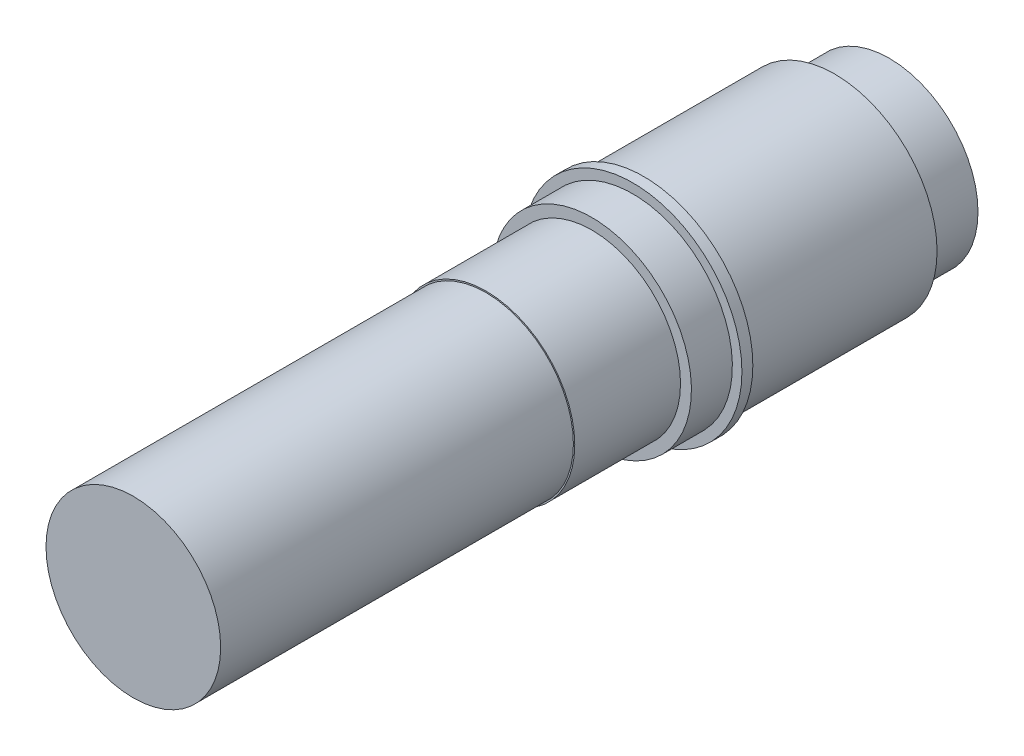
ISO-10303-21;
HEADER;
FILE_DESCRIPTION(('STEP AP214'),'2;1');
FILE_NAME('part.step','',(''),(''),'','','');
FILE_SCHEMA(('AUTOMOTIVE_DESIGN { 1 0 10303 214 1 1 1 1 }'));
ENDSEC;
DATA;
#1=APPLICATION_CONTEXT('core data for automotive mechanical design processes');
#2=APPLICATION_PROTOCOL_DEFINITION('international standard','automotive_design',2000,#1);
#3=PRODUCT_CONTEXT('',#1,'mechanical');
#4=PRODUCT('Part','Part','',(#3));
#5=PRODUCT_RELATED_PRODUCT_CATEGORY('part','',(#4));
#6=PRODUCT_DEFINITION_FORMATION('','',#4);
#7=PRODUCT_DEFINITION_CONTEXT('part definition',#1,'design');
#8=PRODUCT_DEFINITION('design','',#6,#7);
#9=PRODUCT_DEFINITION_SHAPE('','',#8);
#10=(LENGTH_UNIT() NAMED_UNIT(*) SI_UNIT(.MILLI.,.METRE.));
#11=(NAMED_UNIT(*) PLANE_ANGLE_UNIT() SI_UNIT($,.RADIAN.));
#12=(NAMED_UNIT(*) SI_UNIT($,.STERADIAN.) SOLID_ANGLE_UNIT());
#13=UNCERTAINTY_MEASURE_WITH_UNIT(LENGTH_MEASURE(1.E-05),#10,'distance_accuracy_value','');
#14=(GEOMETRIC_REPRESENTATION_CONTEXT(3) GLOBAL_UNCERTAINTY_ASSIGNED_CONTEXT((#13)) GLOBAL_UNIT_ASSIGNED_CONTEXT((#10,
#11,#12)) REPRESENTATION_CONTEXT('',''));
#15=CARTESIAN_POINT('',(0.,0.,0.));
#16=DIRECTION('',(0.,0.,1.));
#17=DIRECTION('',(1.,0.,0.));
#18=AXIS2_PLACEMENT_3D('',#15,#16,#17);
#19=CARTESIAN_POINT('',(139.279894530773,-241.483084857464,-317.356667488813));
#20=DIRECTION('',(0.,0.,1.));
#21=DIRECTION('',(0.,1.,0.));
#22=AXIS2_PLACEMENT_3D('',#19,#20,#21);
#23=PLANE('',#22);
#24=CARTESIAN_POINT('',(71.0299015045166,-173.233091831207,-317.356667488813));
#25=DIRECTION('',(0.,0.,-1.));
#26=DIRECTION('',(-1.,0.,0.));
#27=AXIS2_PLACEMENT_3D('',#24,#25,#26);
#28=CIRCLE('',#27,64.);
#29=CARTESIAN_POINT('',(71.0299015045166,-109.233091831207,-317.356667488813));
#30=VERTEX_POINT('',#29);
#31=EDGE_CURVE('E10',#30,#30,#28,.T.);
#32=ORIENTED_EDGE('',*,*,#31,.T.);
#33=EDGE_LOOP('',(#32));
#34=FACE_BOUND('',#33,.T.);
#35=CARTESIAN_POINT('',(71.0299015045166,-173.233091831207,-317.356667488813));
#36=DIRECTION('',(0.,0.,-1.));
#37=DIRECTION('',(0.,1.,0.));
#38=AXIS2_PLACEMENT_3D('',#35,#36,#37);
#39=CIRCLE('',#38,65.);
#40=CARTESIAN_POINT('',(136.029901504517,-173.233091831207,-317.356667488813));
#41=VERTEX_POINT('',#40);
#42=EDGE_CURVE('E25',#41,#41,#39,.T.);
#43=ORIENTED_EDGE('',*,*,#42,.F.);
#44=EDGE_LOOP('',(#43));
#45=FACE_BOUND('',#44,.T.);
#46=ADVANCED_FACE('F15',(#34,#45),#23,.T.);
#47=CARTESIAN_POINT('',(71.0299015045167,-173.233091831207,-394.856667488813));
#48=DIRECTION('',(0.,0.,1.));
#49=DIRECTION('',(0.,-1.,0.));
#50=AXIS2_PLACEMENT_3D('',#47,#48,#49);
#51=CYLINDRICAL_SURFACE('',#50,65.);
#52=CARTESIAN_POINT('',(71.0299015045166,-173.233091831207,-394.856667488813));
#53=DIRECTION('',(0.,0.,-1.));
#54=DIRECTION('',(0.,1.,0.));
#55=AXIS2_PLACEMENT_3D('',#52,#53,#54);
#56=CIRCLE('',#55,65.);
#57=CARTESIAN_POINT('',(136.029901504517,-173.233091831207,-394.856667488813));
#58=VERTEX_POINT('',#57);
#59=EDGE_CURVE('E80',#58,#58,#56,.T.);
#60=ORIENTED_EDGE('',*,*,#59,.F.);
#61=DIRECTION('',(0.,0.,-1.));
#62=VECTOR('',#61,1.);
#63=CARTESIAN_POINT('',(136.029901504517,-173.233091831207,-356.106667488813));
#64=LINE('',#63,#62);
#65=EDGE_CURVE('E83',#41,#58,#64,.T.);
#66=ORIENTED_EDGE('',*,*,#65,.F.);
#67=ORIENTED_EDGE('',*,*,#42,.T.);
#68=ORIENTED_EDGE('',*,*,#65,.T.);
#69=EDGE_LOOP('',(#60,#66,#67,#68));
#70=FACE_BOUND('',#69,.T.);
#71=ADVANCED_FACE('F120',(#70),#51,.T.);
#72=CARTESIAN_POINT('',(-5.62009215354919,-249.883085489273,-394.856667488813));
#73=DIRECTION('',(0.,0.,1.));
#74=DIRECTION('',(1.,0.,0.));
#75=AXIS2_PLACEMENT_3D('',#72,#73,#74);
#76=PLANE('',#75);
#77=ORIENTED_EDGE('',*,*,#59,.T.);
#78=EDGE_LOOP('',(#77));
#79=FACE_BOUND('',#78,.T.);
#80=CARTESIAN_POINT('',(71.0299015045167,-173.233091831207,-394.856667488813));
#81=DIRECTION('',(0.,0.,-1.));
#82=DIRECTION('',(-1.,0.,0.));
#83=AXIS2_PLACEMENT_3D('',#80,#81,#82);
#84=CIRCLE('',#83,73.);
#85=CARTESIAN_POINT('',(71.0299015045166,-246.233091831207,-394.856667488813));
#86=VERTEX_POINT('',#85);
#87=EDGE_CURVE('E74',#86,#86,#84,.T.);
#88=ORIENTED_EDGE('',*,*,#87,.F.);
#89=EDGE_LOOP('',(#88));
#90=FACE_BOUND('',#89,.T.);
#91=ADVANCED_FACE('F79',(#79,#90),#76,.T.);
#92=CARTESIAN_POINT('',(71.0299015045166,-173.233091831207,-424.856667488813));
#93=DIRECTION('',(0.,0.,1.));
#94=DIRECTION('',(1.,0.,0.));
#95=AXIS2_PLACEMENT_3D('',#92,#93,#94);
#96=CYLINDRICAL_SURFACE('',#95,73.);
#97=CARTESIAN_POINT('',(71.0299015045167,-173.233091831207,-424.856667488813));
#98=DIRECTION('',(0.,0.,-1.));
#99=DIRECTION('',(-1.,0.,0.));
#100=AXIS2_PLACEMENT_3D('',#97,#98,#99);
#101=CIRCLE('',#100,73.);
#102=CARTESIAN_POINT('',(71.0299015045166,-246.233091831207,-424.856667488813));
#103=VERTEX_POINT('',#102);
#104=EDGE_CURVE('E76',#103,#103,#101,.T.);
#105=ORIENTED_EDGE('',*,*,#104,.F.);
#106=DIRECTION('',(0.,0.,-1.));
#107=VECTOR('',#106,1.);
#108=CARTESIAN_POINT('',(71.0299015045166,-246.233091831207,-409.856667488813));
#109=LINE('',#108,#107);
#110=EDGE_CURVE('E71',#86,#103,#109,.T.);
#111=ORIENTED_EDGE('',*,*,#110,.F.);
#112=ORIENTED_EDGE('',*,*,#87,.T.);
#113=ORIENTED_EDGE('',*,*,#110,.T.);
#114=EDGE_LOOP('',(#105,#111,#112,#113));
#115=FACE_BOUND('',#114,.T.);
#116=ADVANCED_FACE('F73',(#115),#96,.T.);
#117=CARTESIAN_POINT('',(-12.9700899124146,-89.2331004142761,-424.856667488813));
#118=DIRECTION('',(0.,0.,1.));
#119=DIRECTION('',(0.,-1.,0.));
#120=AXIS2_PLACEMENT_3D('',#117,#118,#119);
#121=PLANE('',#120);
#122=ORIENTED_EDGE('',*,*,#104,.T.);
#123=EDGE_LOOP('',(#122));
#124=FACE_BOUND('',#123,.T.);
#125=CARTESIAN_POINT('',(71.0299015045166,-173.233091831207,-424.856667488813));
#126=DIRECTION('',(0.,0.,-1.));
#127=DIRECTION('',(-1.,0.,0.));
#128=AXIS2_PLACEMENT_3D('',#125,#126,#127);
#129=CIRCLE('',#128,80.);
#130=CARTESIAN_POINT('',(-8.97009849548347,-173.233091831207,-424.856667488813));
#131=VERTEX_POINT('',#130);
#132=EDGE_CURVE('E91',#131,#131,#129,.T.);
#133=ORIENTED_EDGE('',*,*,#132,.F.);
#134=EDGE_LOOP('',(#133));
#135=FACE_BOUND('',#134,.T.);
#136=ADVANCED_FACE('F135',(#124,#135),#121,.T.);
#137=CARTESIAN_POINT('',(71.0299015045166,-173.233091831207,-432.856667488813));
#138=DIRECTION('',(0.,0.,1.));
#139=DIRECTION('',(1.,0.,0.));
#140=AXIS2_PLACEMENT_3D('',#137,#138,#139);
#141=CYLINDRICAL_SURFACE('',#140,80.);
#142=CARTESIAN_POINT('',(71.0299015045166,-173.233091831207,-432.856667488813));
#143=DIRECTION('',(0.,0.,1.));
#144=DIRECTION('',(1.,0.,0.));
#145=AXIS2_PLACEMENT_3D('',#142,#143,#144);
#146=CIRCLE('',#145,80.);
#147=CARTESIAN_POINT('',(-8.97009849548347,-173.233091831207,-432.856667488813));
#148=VERTEX_POINT('',#147);
#149=EDGE_CURVE('E88',#148,#148,#146,.T.);
#150=ORIENTED_EDGE('',*,*,#149,.T.);
#151=DIRECTION('',(0.,0.,-1.));
#152=VECTOR('',#151,1.);
#153=CARTESIAN_POINT('',(-8.97009849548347,-173.233091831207,-428.856667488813));
#154=LINE('',#153,#152);
#155=EDGE_CURVE('E94',#131,#148,#154,.T.);
#156=ORIENTED_EDGE('',*,*,#155,.F.);
#157=ORIENTED_EDGE('',*,*,#132,.T.);
#158=ORIENTED_EDGE('',*,*,#155,.T.);
#159=EDGE_LOOP('',(#150,#156,#157,#158));
#160=FACE_BOUND('',#159,.T.);
#161=ADVANCED_FACE('F138',(#160),#141,.T.);
#162=CARTESIAN_POINT('',(155.029892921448,-257.233083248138,-432.856667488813));
#163=DIRECTION('',(0.,0.,-1.));
#164=DIRECTION('',(-1.,0.,0.));
#165=AXIS2_PLACEMENT_3D('',#162,#163,#164);
#166=PLANE('',#165);
#167=CARTESIAN_POINT('',(71.0299015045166,-173.233091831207,-432.856667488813));
#168=DIRECTION('',(0.,0.,-1.));
#169=DIRECTION('',(-1.,0.,0.));
#170=AXIS2_PLACEMENT_3D('',#167,#168,#169);
#171=CIRCLE('',#170,75.);
#172=CARTESIAN_POINT('',(71.0299015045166,-98.2330918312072,-432.856667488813));
#173=VERTEX_POINT('',#172);
#174=EDGE_CURVE('E100',#173,#173,#171,.T.);
#175=ORIENTED_EDGE('',*,*,#174,.F.);
#176=EDGE_LOOP('',(#175));
#177=FACE_BOUND('',#176,.T.);
#178=ORIENTED_EDGE('',*,*,#149,.F.);
#179=EDGE_LOOP('',(#178));
#180=FACE_BOUND('',#179,.T.);
#181=ADVANCED_FACE('F142',(#177,#180),#166,.T.);
#182=CARTESIAN_POINT('',(71.0299015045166,-173.233091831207,-572.856667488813));
#183=DIRECTION('',(0.,0.,1.));
#184=DIRECTION('',(1.,0.,0.));
#185=AXIS2_PLACEMENT_3D('',#182,#183,#184);
#186=CYLINDRICAL_SURFACE('',#185,75.);
#187=CARTESIAN_POINT('',(71.0299015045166,-173.233091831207,-572.856667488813));
#188=DIRECTION('',(0.,0.,1.));
#189=DIRECTION('',(1.,0.,0.));
#190=AXIS2_PLACEMENT_3D('',#187,#188,#189);
#191=CIRCLE('',#190,75.);
#192=CARTESIAN_POINT('',(71.0299015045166,-98.2330918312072,-572.856667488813));
#193=VERTEX_POINT('',#192);
#194=EDGE_CURVE('E97',#193,#193,#191,.T.);
#195=ORIENTED_EDGE('',*,*,#194,.T.);
#196=DIRECTION('',(0.,0.,-1.));
#197=VECTOR('',#196,1.);
#198=CARTESIAN_POINT('',(71.0299015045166,-98.2330918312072,-502.856667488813));
#199=LINE('',#198,#197);
#200=EDGE_CURVE('E103',#173,#193,#199,.T.);
#201=ORIENTED_EDGE('',*,*,#200,.F.);
#202=ORIENTED_EDGE('',*,*,#174,.T.);
#203=ORIENTED_EDGE('',*,*,#200,.T.);
#204=EDGE_LOOP('',(#195,#201,#202,#203));
#205=FACE_BOUND('',#204,.T.);
#206=ADVANCED_FACE('F146',(#205),#186,.T.);
#207=CARTESIAN_POINT('',(-7.72009789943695,-251.983091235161,-572.856667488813));
#208=DIRECTION('',(0.,0.,-1.));
#209=DIRECTION('',(0.,1.,0.));
#210=AXIS2_PLACEMENT_3D('',#207,#208,#209);
#211=PLANE('',#210);
#212=CARTESIAN_POINT('',(71.0299015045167,-173.233091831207,-572.856667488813));
#213=DIRECTION('',(0.,0.,-1.));
#214=DIRECTION('',(-1.,0.,0.));
#215=AXIS2_PLACEMENT_3D('',#212,#213,#214);
#216=CIRCLE('',#215,65.);
#217=CARTESIAN_POINT('',(136.029901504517,-173.233091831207,-572.856667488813));
#218=VERTEX_POINT('',#217);
#219=EDGE_CURVE('E108',#218,#218,#216,.T.);
#220=ORIENTED_EDGE('',*,*,#219,.F.);
#221=EDGE_LOOP('',(#220));
#222=FACE_BOUND('',#221,.T.);
#223=ORIENTED_EDGE('',*,*,#194,.F.);
#224=EDGE_LOOP('',(#223));
#225=FACE_BOUND('',#224,.T.);
#226=ADVANCED_FACE('F150',(#222,#225),#211,.T.);
#227=CARTESIAN_POINT('',(71.0299015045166,-173.233091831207,-612.856667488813));
#228=DIRECTION('',(0.,0.,1.));
#229=DIRECTION('',(1.,0.,0.));
#230=AXIS2_PLACEMENT_3D('',#227,#228,#229);
#231=CYLINDRICAL_SURFACE('',#230,65.);
#232=CARTESIAN_POINT('',(71.0299015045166,-173.233091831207,-612.856667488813));
#233=DIRECTION('',(0.,0.,1.));
#234=DIRECTION('',(1.,0.,0.));
#235=AXIS2_PLACEMENT_3D('',#232,#233,#234);
#236=CIRCLE('',#235,65.);
#237=CARTESIAN_POINT('',(136.029901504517,-173.233091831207,-612.856667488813));
#238=VERTEX_POINT('',#237);
#239=EDGE_CURVE('E106',#238,#238,#236,.T.);
#240=ORIENTED_EDGE('',*,*,#239,.T.);
#241=DIRECTION('',(0.,0.,-1.));
#242=VECTOR('',#241,1.);
#243=CARTESIAN_POINT('',(136.029901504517,-173.233091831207,-592.856667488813));
#244=LINE('',#243,#242);
#245=EDGE_CURVE('E61',#218,#238,#244,.T.);
#246=ORIENTED_EDGE('',*,*,#245,.F.);
#247=ORIENTED_EDGE('',*,*,#219,.T.);
#248=ORIENTED_EDGE('',*,*,#245,.T.);
#249=EDGE_LOOP('',(#240,#246,#247,#248));
#250=FACE_BOUND('',#249,.T.);
#251=ADVANCED_FACE('F154',(#250),#231,.T.);
#252=CARTESIAN_POINT('',(2.77990847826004,-104.983098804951,-612.856667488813));
#253=DIRECTION('',(0.,0.,-1.));
#254=DIRECTION('',(1.,0.,0.));
#255=AXIS2_PLACEMENT_3D('',#252,#253,#254);
#256=PLANE('',#255);
#257=ORIENTED_EDGE('',*,*,#239,.F.);
#258=EDGE_LOOP('',(#257));
#259=FACE_BOUND('',#258,.T.);
#260=ADVANCED_FACE('F118',(#259),#256,.T.);
#261=CARTESIAN_POINT('',(71.0299015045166,-173.233091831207,-317.356667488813));
#262=DIRECTION('',(0.,0.,1.));
#263=DIRECTION('',(1.,0.,0.));
#264=AXIS2_PLACEMENT_3D('',#261,#262,#263);
#265=CYLINDRICAL_SURFACE('',#264,64.);
#266=ORIENTED_EDGE('',*,*,#31,.F.);
#267=DIRECTION('',(0.,0.,-1.));
#268=VECTOR('',#267,1.);
#269=CARTESIAN_POINT('',(71.0299015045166,-109.233091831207,-188.106667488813));
#270=LINE('',#269,#268);
#271=CARTESIAN_POINT('',(71.0299015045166,-109.233091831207,-58.8566674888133));
#272=VERTEX_POINT('',#271);
#273=EDGE_CURVE('E19',#272,#30,#270,.T.);
#274=ORIENTED_EDGE('',*,*,#273,.F.);
#275=CARTESIAN_POINT('',(71.0299015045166,-173.233091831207,-58.8566674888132));
#276=DIRECTION('',(0.,0.,-1.));
#277=DIRECTION('',(-1.,0.,0.));
#278=AXIS2_PLACEMENT_3D('',#275,#276,#277);
#279=CIRCLE('',#278,64.);
#280=EDGE_CURVE('E110',#272,#272,#279,.T.);
#281=ORIENTED_EDGE('',*,*,#280,.T.);
#282=ORIENTED_EDGE('',*,*,#273,.T.);
#283=EDGE_LOOP('',(#266,#274,#281,#282));
#284=FACE_BOUND('',#283,.T.);
#285=ADVANCED_FACE('F111',(#284),#265,.T.);
#286=CARTESIAN_POINT('',(138.22989910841,-106.033094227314,-58.8566674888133));
#287=DIRECTION('',(0.,0.,1.));
#288=DIRECTION('',(-1.,0.,0.));
#289=AXIS2_PLACEMENT_3D('',#286,#287,#288);
#290=PLANE('',#289);
#291=ORIENTED_EDGE('',*,*,#280,.F.);
#292=EDGE_LOOP('',(#291));
#293=FACE_BOUND('',#292,.T.);
#294=ADVANCED_FACE('F17',(#293),#290,.T.);
#295=CLOSED_SHELL('',(#46,#71,#91,#116,#136,#161,#181,#206,#226,#251,#260,#285,#294));
#296=MANIFOLD_SOLID_BREP('B1',#295);
#297=ADVANCED_BREP_SHAPE_REPRESENTATION('',(#18,#296),#14);
#298=SHAPE_DEFINITION_REPRESENTATION(#9,#297);
ENDSEC;
END-ISO-10303-21;
